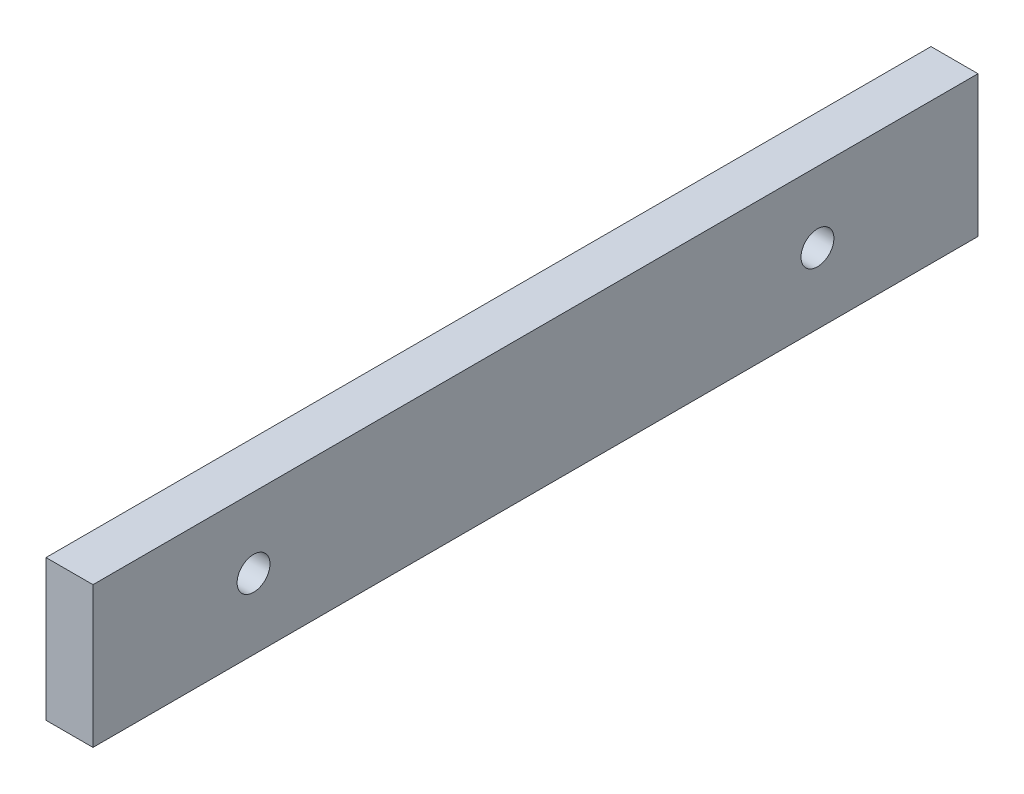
from build123d import *

# Parameters (mm, degrees)
SKETCH_1_W          = 3
SKETCH_1_H          = 9
EXTRUDE_1_DEPTH     = 56.5
SKETCH_2_R          = 1.05
CUT_EXTRUDE_1_DEPTH = 58.290924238


with BuildPart() as part:
    # Sketch 1 → Extrude 1 (new body)
    with BuildSketch(Plane.XY):
        with Locations((1.5, 4.5)):
            Rectangle(SKETCH_1_W, SKETCH_1_H)
    extrude(amount=EXTRUDE_1_DEPTH)

    # Sketch 2 → Cut-Extrude 1 (cut, through all)
    with BuildSketch(Plane.ZY):
        with Locations(Location((10.25, 4.5, 0), (0, 0, 270))):
            Circle(SKETCH_2_R)
        with Locations(Location((46.25, 4.5, 0), (0, 0, 270))):
            Circle(SKETCH_2_R)
    extrude(amount=-CUT_EXTRUDE_1_DEPTH, mode=Mode.SUBTRACT)


solid = part.part
